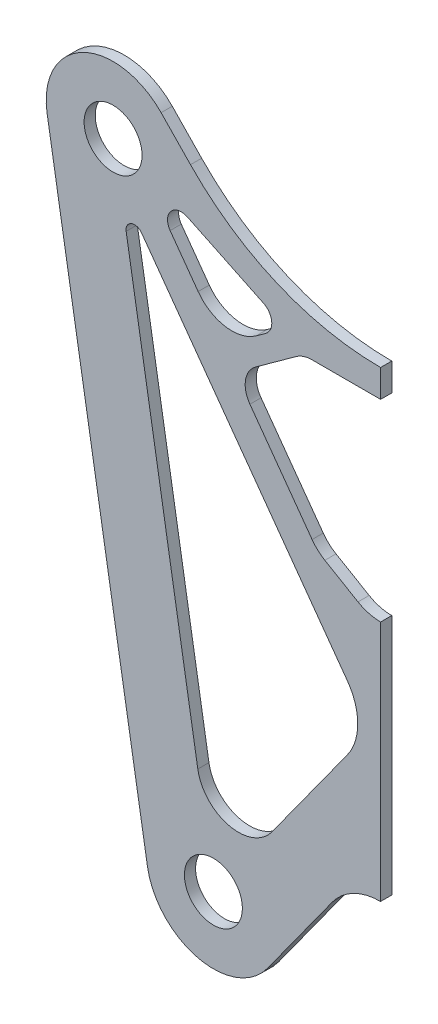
ISO-10303-21;
HEADER;
FILE_DESCRIPTION(('STEP AP214'),'2;1');
FILE_NAME('part.step','',(''),(''),'','','');
FILE_SCHEMA(('AUTOMOTIVE_DESIGN { 1 0 10303 214 1 1 1 1 }'));
ENDSEC;
DATA;
#1=APPLICATION_CONTEXT('core data for automotive mechanical design processes');
#2=APPLICATION_PROTOCOL_DEFINITION('international standard','automotive_design',2000,#1);
#3=PRODUCT_CONTEXT('',#1,'mechanical');
#4=PRODUCT('Part','Part','',(#3));
#5=PRODUCT_RELATED_PRODUCT_CATEGORY('part','',(#4));
#6=PRODUCT_DEFINITION_FORMATION('','',#4);
#7=PRODUCT_DEFINITION_CONTEXT('part definition',#1,'design');
#8=PRODUCT_DEFINITION('design','',#6,#7);
#9=PRODUCT_DEFINITION_SHAPE('','',#8);
#10=(LENGTH_UNIT() NAMED_UNIT(*) SI_UNIT(.MILLI.,.METRE.));
#11=(NAMED_UNIT(*) PLANE_ANGLE_UNIT() SI_UNIT($,.RADIAN.));
#12=(NAMED_UNIT(*) SI_UNIT($,.STERADIAN.) SOLID_ANGLE_UNIT());
#13=UNCERTAINTY_MEASURE_WITH_UNIT(LENGTH_MEASURE(1.E-05),#10,'distance_accuracy_value','');
#14=(GEOMETRIC_REPRESENTATION_CONTEXT(3) GLOBAL_UNCERTAINTY_ASSIGNED_CONTEXT((#13)) GLOBAL_UNIT_ASSIGNED_CONTEXT((#10,
#11,#12)) REPRESENTATION_CONTEXT('',''));
#15=CARTESIAN_POINT('',(0.,0.,0.));
#16=DIRECTION('',(0.,0.,1.));
#17=DIRECTION('',(1.,0.,0.));
#18=AXIS2_PLACEMENT_3D('',#15,#16,#17);
#19=CARTESIAN_POINT('',(-188.917466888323,34.2822252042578,5.));
#20=DIRECTION('',(0.,0.,-1.));
#21=DIRECTION('',(-1.,0.,0.));
#22=AXIS2_PLACEMENT_3D('',#19,#20,#21);
#23=PLANE('',#22);
#24=CARTESIAN_POINT('',(-158.320199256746,14.9860483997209,5.));
#25=DIRECTION('',(0.,0.,1.));
#26=DIRECTION('',(-1.,0.,0.));
#27=AXIS2_PLACEMENT_3D('',#24,#25,#26);
#28=CIRCLE('',#27,6.17368139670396);
#29=CARTESIAN_POINT('',(-155.644158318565,20.5496036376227,5.));
#30=VERTEX_POINT('',#29);
#31=CARTESIAN_POINT('',(-163.325074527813,11.3714162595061,5.));
#32=VERTEX_POINT('',#31);
#33=EDGE_CURVE('E273',#30,#32,#28,.T.);
#34=ORIENTED_EDGE('',*,*,#33,.F.);
#35=DIRECTION('',(-0.901173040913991,0.433459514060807,0.));
#36=VECTOR('',#35,1.);
#37=CARTESIAN_POINT('',(-155.644158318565,20.5496036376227,5.));
#38=LINE('',#37,#36);
#39=CARTESIAN_POINT('',(-121.443837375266,4.09942833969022,5.));
#40=VERTEX_POINT('',#39);
#41=EDGE_CURVE('E285',#40,#30,#38,.T.);
#42=ORIENTED_EDGE('',*,*,#41,.F.);
#43=CARTESIAN_POINT('',(-124.289603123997,-1.8169889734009,5.));
#44=DIRECTION('',(0.,0.,1.));
#45=DIRECTION('',(-1.,0.,0.));
#46=AXIS2_PLACEMENT_3D('',#43,#44,#45);
#47=CIRCLE('',#46,6.56524001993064);
#48=CARTESIAN_POINT('',(-120.445717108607,-7.1392926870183,5.));
#49=VERTEX_POINT('',#48);
#50=EDGE_CURVE('E282',#49,#40,#47,.T.);
#51=ORIENTED_EDGE('',*,*,#50,.F.);
#52=DIRECTION('',(0.810679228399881,0.585490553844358,0.));
#53=VECTOR('',#52,1.);
#54=CARTESIAN_POINT('',(-120.445717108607,-7.1392926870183,5.));
#55=LINE('',#54,#53);
#56=CARTESIAN_POINT('',(-124.720304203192,-10.2264944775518,5.));
#57=VERTEX_POINT('',#56);
#58=EDGE_CURVE('E280',#57,#49,#55,.T.);
#59=ORIENTED_EDGE('',*,*,#58,.F.);
#60=CARTESIAN_POINT('',(-135.640120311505,4.89325090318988,5.));
#61=DIRECTION('',(0.,0.,1.));
#62=DIRECTION('',(-1.,0.,0.));
#63=AXIS2_PLACEMENT_3D('',#60,#61,#62);
#64=CIRCLE('',#63,18.6507126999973);
#65=CARTESIAN_POINT('',(-150.759865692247,-6.02656520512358,5.));
#66=VERTEX_POINT('',#65);
#67=EDGE_CURVE('E278',#66,#57,#64,.T.);
#68=ORIENTED_EDGE('',*,*,#67,.F.);
#69=DIRECTION('',(0.585490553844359,-0.810679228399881,0.));
#70=VECTOR('',#69,1.);
#71=CARTESIAN_POINT('',(-150.759865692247,-6.02656520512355,5.));
#72=LINE('',#71,#70);
#73=EDGE_CURVE('E275',#32,#66,#72,.T.);
#74=ORIENTED_EDGE('',*,*,#73,.F.);
#75=EDGE_LOOP('',(#34,#42,#51,#59,#68,#74));
#76=FACE_BOUND('',#75,.T.);
#77=CARTESIAN_POINT('',(-188.917466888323,34.2822252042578,5.));
#78=DIRECTION('',(0.,0.,1.));
#79=DIRECTION('',(1.,0.,0.));
#80=AXIS2_PLACEMENT_3D('',#77,#78,#79);
#81=CIRCLE('',#80,13.);
#82=CARTESIAN_POINT('',(-175.917466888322,34.2822252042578,5.));
#83=VERTEX_POINT('',#82);
#84=EDGE_CURVE('E324',#83,#83,#81,.T.);
#85=ORIENTED_EDGE('',*,*,#84,.F.);
#86=EDGE_LOOP('',(#85));
#87=FACE_BOUND('',#86,.T.);
#88=CARTESIAN_POINT('',(-188.917466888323,34.2822252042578,5.));
#89=DIRECTION('',(0.,0.,1.));
#90=DIRECTION('',(-1.,0.,0.));
#91=AXIS2_PLACEMENT_3D('',#88,#89,#90);
#92=CIRCLE('',#91,30.);
#93=CARTESIAN_POINT('',(-167.359662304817,55.1451363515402,5.));
#94=VERTEX_POINT('',#93);
#95=CARTESIAN_POINT('',(-218.509284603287,29.3502555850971,5.));
#96=VERTEX_POINT('',#95);
#97=EDGE_CURVE('E330',#94,#96,#92,.T.);
#98=ORIENTED_EDGE('',*,*,#97,.T.);
#99=DIRECTION('',(0.164398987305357,-0.986393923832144,0.));
#100=VECTOR('',#99,1.);
#101=CARTESIAN_POINT('',(-218.509284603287,29.3502555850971,5.));
#102=LINE('',#101,#100);
#103=CARTESIAN_POINT('',(-173.509284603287,-240.649744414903,5.));
#104=VERTEX_POINT('',#103);
#105=EDGE_CURVE('E333',#96,#104,#102,.T.);
#106=ORIENTED_EDGE('',*,*,#105,.T.);
#107=CARTESIAN_POINT('',(-143.917466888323,-235.717774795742,5.));
#108=DIRECTION('',(0.,0.,1.));
#109=DIRECTION('',(-1.,0.,0.));
#110=AXIS2_PLACEMENT_3D('',#107,#108,#109);
#111=CIRCLE('',#110,30.);
#112=CARTESIAN_POINT('',(-119.597090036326,-253.282491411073,5.));
#113=VERTEX_POINT('',#112);
#114=EDGE_CURVE('E336',#104,#113,#111,.T.);
#115=ORIENTED_EDGE('',*,*,#114,.T.);
#116=DIRECTION('',(0.585490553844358,0.810679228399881,0.));
#117=VECTOR('',#116,1.);
#118=CARTESIAN_POINT('',(-119.597090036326,-253.282491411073,5.));
#119=LINE('',#118,#117);
#120=CARTESIAN_POINT('',(-90.5828600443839,-213.108942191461,5.));
#121=VERTEX_POINT('',#120);
#122=EDGE_CURVE('E338',#113,#121,#119,.T.);
#123=ORIENTED_EDGE('',*,*,#122,.T.);
#124=CARTESIAN_POINT('',(-68.9174668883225,-228.756170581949,5.));
#125=DIRECTION('',(0.,0.,-1.));
#126=DIRECTION('',(-1.,0.,0.));
#127=AXIS2_PLACEMENT_3D('',#124,#125,#126);
#128=CIRCLE('',#127,26.7249886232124);
#129=CARTESIAN_POINT('',(-68.9174668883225,-202.031181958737,5.));
#130=VERTEX_POINT('',#129);
#131=EDGE_CURVE('E340',#121,#130,#128,.T.);
#132=ORIENTED_EDGE('',*,*,#131,.T.);
#133=DIRECTION('',(0.,1.,0.));
#134=VECTOR('',#133,1.);
#135=CARTESIAN_POINT('',(-68.9174668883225,-93.4706588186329,5.));
#136=LINE('',#135,#134);
#137=CARTESIAN_POINT('',(-68.9174668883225,-93.4706588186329,5.));
#138=VERTEX_POINT('',#137);
#139=EDGE_CURVE('E342',#130,#138,#136,.T.);
#140=ORIENTED_EDGE('',*,*,#139,.T.);
#141=CARTESIAN_POINT('',(-68.9174668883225,-73.4322190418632,5.));
#142=DIRECTION('',(0.,0.,-1.));
#143=DIRECTION('',(1.,0.,0.));
#144=AXIS2_PLACEMENT_3D('',#141,#142,#143);
#145=CIRCLE('',#144,20.0384397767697);
#146=CARTESIAN_POINT('',(-79.0512504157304,-90.7193674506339,5.));
#147=VERTEX_POINT('',#146);
#148=EDGE_CURVE('E344',#138,#147,#145,.T.);
#149=ORIENTED_EDGE('',*,*,#148,.T.);
#150=DIRECTION('',(-0.862699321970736,0.505717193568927,0.));
#151=VECTOR('',#150,1.);
#152=CARTESIAN_POINT('',(-93.9174668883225,-82.0047422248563,5.));
#153=LINE('',#152,#151);
#154=CARTESIAN_POINT('',(-93.9174668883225,-82.0047422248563,5.));
#155=VERTEX_POINT('',#154);
#156=EDGE_CURVE('E346',#147,#155,#153,.T.);
#157=ORIENTED_EDGE('',*,*,#156,.T.);
#158=CARTESIAN_POINT('',(-84.4106413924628,-65.7871170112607,5.));
#159=DIRECTION('',(0.,0.,-1.));
#160=DIRECTION('',(1.,0.,0.));
#161=AXIS2_PLACEMENT_3D('',#158,#159,#160);
#162=CIRCLE('',#161,18.7986993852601);
#163=CARTESIAN_POINT('',(-99.6503565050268,-76.7935779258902,5.));
#164=VERTEX_POINT('',#163);
#165=EDGE_CURVE('E348',#155,#164,#162,.T.);
#166=ORIENTED_EDGE('',*,*,#165,.T.);
#167=DIRECTION('',(-0.585490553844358,0.810679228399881,0.));
#168=VECTOR('',#167,1.);
#169=CARTESIAN_POINT('',(-127.534912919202,-38.1841921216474,5.));
#170=LINE('',#169,#168);
#171=CARTESIAN_POINT('',(-127.534912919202,-38.1841921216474,5.));
#172=VERTEX_POINT('',#171);
#173=EDGE_CURVE('E350',#164,#172,#170,.T.);
#174=ORIENTED_EDGE('',*,*,#173,.T.);
#175=CARTESIAN_POINT('',(-118.402879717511,-31.5888348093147,5.));
#176=DIRECTION('',(0.,0.,-1.));
#177=DIRECTION('',(1.,0.,0.));
#178=AXIS2_PLACEMENT_3D('',#175,#176,#177);
#179=CIRCLE('',#178,11.2646690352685);
#180=CARTESIAN_POINT('',(-124.998237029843,-22.4568016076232,5.));
#181=VERTEX_POINT('',#180);
#182=EDGE_CURVE('E352',#172,#181,#179,.T.);
#183=ORIENTED_EDGE('',*,*,#182,.T.);
#184=DIRECTION('',(0.810679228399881,0.585490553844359,0.));
#185=VECTOR('',#184,1.);
#186=CARTESIAN_POINT('',(-106.712824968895,-9.25067067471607,5.));
#187=LINE('',#186,#185);
#188=CARTESIAN_POINT('',(-106.712824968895,-9.25067067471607,5.));
#189=VERTEX_POINT('',#188);
#190=EDGE_CURVE('E354',#181,#189,#187,.T.);
#191=ORIENTED_EDGE('',*,*,#190,.T.);
#192=CARTESIAN_POINT('',(-99.7671006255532,-18.8678274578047,5.));
#193=DIRECTION('',(0.,0.,-1.));
#194=DIRECTION('',(1.,0.,0.));
#195=AXIS2_PLACEMENT_3D('',#192,#193,#194);
#196=CIRCLE('',#195,11.8630852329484);
#197=CARTESIAN_POINT('',(-99.7671006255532,-7.0047422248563,5.));
#198=VERTEX_POINT('',#197);
#199=EDGE_CURVE('E356',#189,#198,#196,.T.);
#200=ORIENTED_EDGE('',*,*,#199,.T.);
#201=DIRECTION('',(1.,0.,0.));
#202=VECTOR('',#201,1.);
#203=CARTESIAN_POINT('',(-93.9174668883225,-7.00474222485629,5.));
#204=LINE('',#203,#202);
#205=CARTESIAN_POINT('',(-68.9174668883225,-7.00474222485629,5.));
#206=VERTEX_POINT('',#205);
#207=EDGE_CURVE('E358',#198,#206,#204,.T.);
#208=ORIENTED_EDGE('',*,*,#207,.T.);
#209=DIRECTION('',(0.,1.,0.));
#210=VECTOR('',#209,1.);
#211=CARTESIAN_POINT('',(-68.9174668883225,5.39341110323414,5.));
#212=LINE('',#211,#210);
#213=CARTESIAN_POINT('',(-68.9174668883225,5.39341110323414,5.));
#214=VERTEX_POINT('',#213);
#215=EDGE_CURVE('E360',#206,#214,#212,.T.);
#216=ORIENTED_EDGE('',*,*,#215,.T.);
#217=CARTESIAN_POINT('',(-68.9174668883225,124.056128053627,5.));
#218=DIRECTION('',(0.,0.,-1.));
#219=DIRECTION('',(1.,0.,0.));
#220=AXIS2_PLACEMENT_3D('',#217,#218,#219);
#221=CIRCLE('',#220,118.662716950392);
#222=CARTESIAN_POINT('',(-154.187722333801,41.534470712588,5.));
#223=VERTEX_POINT('',#222);
#224=EDGE_CURVE('E362',#214,#223,#221,.T.);
#225=ORIENTED_EDGE('',*,*,#224,.T.);
#226=DIRECTION('',(-0.69543037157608,0.718593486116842,0.));
#227=VECTOR('',#226,1.);
#228=CARTESIAN_POINT('',(-167.359662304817,55.1451363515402,5.));
#229=LINE('',#228,#227);
#230=EDGE_CURVE('E364',#223,#94,#229,.T.);
#231=ORIENTED_EDGE('',*,*,#230,.T.);
#232=EDGE_LOOP('',(#98,#106,#115,#123,#132,#140,#149,#157,#166,#174,#183,#191,#200,#208,#216,
#225,#231));
#233=FACE_BOUND('',#232,.T.);
#234=CARTESIAN_POINT('',(-143.917466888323,-235.717774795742,5.));
#235=DIRECTION('',(0.,0.,1.));
#236=DIRECTION('',(1.,0.,0.));
#237=AXIS2_PLACEMENT_3D('',#234,#235,#236);
#238=CIRCLE('',#237,13.);
#239=CARTESIAN_POINT('',(-130.917466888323,-235.717774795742,5.));
#240=VERTEX_POINT('',#239);
#241=EDGE_CURVE('E318',#240,#240,#238,.T.);
#242=ORIENTED_EDGE('',*,*,#241,.F.);
#243=EDGE_LOOP('',(#242));
#244=FACE_BOUND('',#243,.T.);
#245=CARTESIAN_POINT('',(-103.663011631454,-138.13402657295,5.));
#246=DIRECTION('',(0.,0.,1.));
#247=DIRECTION('',(1.,0.,0.));
#248=AXIS2_PLACEMENT_3D('',#245,#246,#247);
#249=CIRCLE('',#248,24.5009120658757);
#250=CARTESIAN_POINT('',(-83.8006311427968,-152.479079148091,5.));
#251=VERTEX_POINT('',#250);
#252=CARTESIAN_POINT('',(-83.8006311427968,-123.788973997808,5.));
#253=VERTEX_POINT('',#252);
#254=EDGE_CURVE('E222',#251,#253,#249,.T.);
#255=ORIENTED_EDGE('',*,*,#254,.F.);
#256=DIRECTION('',(0.585490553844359,0.810679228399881,0.));
#257=VECTOR('',#256,1.);
#258=CARTESIAN_POINT('',(-117.668529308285,-199.373091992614,5.));
#259=LINE('',#258,#257);
#260=CARTESIAN_POINT('',(-117.668529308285,-199.373091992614,5.));
#261=VERTEX_POINT('',#260);
#262=EDGE_CURVE('E251',#261,#251,#259,.T.);
#263=ORIENTED_EDGE('',*,*,#262,.F.);
#264=CARTESIAN_POINT('',(-132.665320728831,-188.542075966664,5.));
#265=DIRECTION('',(0.,0.,1.));
#266=DIRECTION('',(1.,0.,0.));
#267=AXIS2_PLACEMENT_3D('',#264,#265,#266);
#268=CIRCLE('',#267,18.499044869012);
#269=CARTESIAN_POINT('',(-150.912666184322,-191.583300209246,5.));
#270=VERTEX_POINT('',#269);
#271=EDGE_CURVE('E249',#270,#261,#268,.T.);
#272=ORIENTED_EDGE('',*,*,#271,.F.);
#273=DIRECTION('',(0.164398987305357,-0.986393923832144,0.));
#274=VECTOR('',#273,1.);
#275=CARTESIAN_POINT('',(-183.047741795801,1.22715345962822,5.));
#276=LINE('',#275,#274);
#277=CARTESIAN_POINT('',(-183.047741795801,1.22715345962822,5.));
#278=VERTEX_POINT('',#277);
#279=EDGE_CURVE('E245',#278,#270,#276,.T.);
#280=ORIENTED_EDGE('',*,*,#279,.F.);
#281=CARTESIAN_POINT('',(-179.269592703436,1.8568449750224,5.));
#282=DIRECTION('',(0.,0.,1.));
#283=DIRECTION('',(1.,0.,0.));
#284=AXIS2_PLACEMENT_3D('',#281,#282,#283);
#285=CIRCLE('',#284,3.8302639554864);
#286=CARTESIAN_POINT('',(-176.164477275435,4.09942833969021,5.));
#287=VERTEX_POINT('',#286);
#288=EDGE_CURVE('E243',#287,#278,#285,.T.);
#289=ORIENTED_EDGE('',*,*,#288,.F.);
#290=DIRECTION('',(-0.585490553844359,0.810679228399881,0.));
#291=VECTOR('',#290,1.);
#292=CARTESIAN_POINT('',(-83.8006311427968,-123.788973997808,5.));
#293=LINE('',#292,#291);
#294=EDGE_CURVE('E230',#253,#287,#293,.T.);
#295=ORIENTED_EDGE('',*,*,#294,.F.);
#296=EDGE_LOOP('',(#255,#263,#272,#280,#289,#295));
#297=FACE_BOUND('',#296,.T.);
#298=ADVANCED_FACE('F31',(#76,#87,#233,#244,#297),#23,.F.);
#299=CARTESIAN_POINT('',(-188.917466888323,34.2822252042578,0.));
#300=DIRECTION('',(0.,0.,-1.));
#301=DIRECTION('',(-1.,0.,0.));
#302=AXIS2_PLACEMENT_3D('',#299,#300,#301);
#303=PLANE('',#302);
#304=DIRECTION('',(-0.901173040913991,0.433459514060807,0.));
#305=VECTOR('',#304,1.);
#306=CARTESIAN_POINT('',(-155.644158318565,20.5496036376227,0.));
#307=LINE('',#306,#305);
#308=CARTESIAN_POINT('',(-121.443837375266,4.09942833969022,0.));
#309=VERTEX_POINT('',#308);
#310=CARTESIAN_POINT('',(-155.644158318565,20.5496036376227,0.));
#311=VERTEX_POINT('',#310);
#312=EDGE_CURVE('E276',#309,#311,#307,.T.);
#313=ORIENTED_EDGE('',*,*,#312,.T.);
#314=CARTESIAN_POINT('',(-158.320199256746,14.9860483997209,0.));
#315=DIRECTION('',(0.,0.,1.));
#316=DIRECTION('',(-1.,0.,0.));
#317=AXIS2_PLACEMENT_3D('',#314,#315,#316);
#318=CIRCLE('',#317,6.17368139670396);
#319=CARTESIAN_POINT('',(-163.325074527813,11.3714162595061,0.));
#320=VERTEX_POINT('',#319);
#321=EDGE_CURVE('E238',#311,#320,#318,.T.);
#322=ORIENTED_EDGE('',*,*,#321,.T.);
#323=DIRECTION('',(0.585490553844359,-0.810679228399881,0.));
#324=VECTOR('',#323,1.);
#325=CARTESIAN_POINT('',(-150.759865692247,-6.02656520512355,0.));
#326=LINE('',#325,#324);
#327=CARTESIAN_POINT('',(-150.759865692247,-6.02656520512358,0.));
#328=VERTEX_POINT('',#327);
#329=EDGE_CURVE('E290',#320,#328,#326,.T.);
#330=ORIENTED_EDGE('',*,*,#329,.T.);
#331=CARTESIAN_POINT('',(-135.640120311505,4.89325090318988,0.));
#332=DIRECTION('',(0.,0.,1.));
#333=DIRECTION('',(-1.,0.,0.));
#334=AXIS2_PLACEMENT_3D('',#331,#332,#333);
#335=CIRCLE('',#334,18.6507126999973);
#336=CARTESIAN_POINT('',(-124.720304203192,-10.2264944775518,0.));
#337=VERTEX_POINT('',#336);
#338=EDGE_CURVE('E293',#328,#337,#335,.T.);
#339=ORIENTED_EDGE('',*,*,#338,.T.);
#340=DIRECTION('',(0.810679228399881,0.585490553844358,0.));
#341=VECTOR('',#340,1.);
#342=CARTESIAN_POINT('',(-120.445717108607,-7.1392926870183,0.));
#343=LINE('',#342,#341);
#344=CARTESIAN_POINT('',(-120.445717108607,-7.1392926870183,0.));
#345=VERTEX_POINT('',#344);
#346=EDGE_CURVE('E296',#337,#345,#343,.T.);
#347=ORIENTED_EDGE('',*,*,#346,.T.);
#348=CARTESIAN_POINT('',(-124.289603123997,-1.8169889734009,0.));
#349=DIRECTION('',(0.,0.,1.));
#350=DIRECTION('',(-1.,0.,0.));
#351=AXIS2_PLACEMENT_3D('',#348,#349,#350);
#352=CIRCLE('',#351,6.56524001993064);
#353=EDGE_CURVE('E299',#345,#309,#352,.T.);
#354=ORIENTED_EDGE('',*,*,#353,.T.);
#355=EDGE_LOOP('',(#313,#322,#330,#339,#347,#354));
#356=FACE_BOUND('',#355,.T.);
#357=CARTESIAN_POINT('',(-188.917466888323,34.2822252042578,0.));
#358=DIRECTION('',(0.,0.,1.));
#359=DIRECTION('',(1.,0.,0.));
#360=AXIS2_PLACEMENT_3D('',#357,#358,#359);
#361=CIRCLE('',#360,13.);
#362=CARTESIAN_POINT('',(-175.917466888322,34.2822252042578,0.));
#363=VERTEX_POINT('',#362);
#364=EDGE_CURVE('E321',#363,#363,#361,.T.);
#365=ORIENTED_EDGE('',*,*,#364,.T.);
#366=EDGE_LOOP('',(#365));
#367=FACE_BOUND('',#366,.T.);
#368=CARTESIAN_POINT('',(-188.917466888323,34.2822252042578,0.));
#369=DIRECTION('',(0.,0.,1.));
#370=DIRECTION('',(-1.,0.,0.));
#371=AXIS2_PLACEMENT_3D('',#368,#369,#370);
#372=CIRCLE('',#371,30.);
#373=CARTESIAN_POINT('',(-167.359662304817,55.1451363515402,0.));
#374=VERTEX_POINT('',#373);
#375=CARTESIAN_POINT('',(-218.509284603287,29.3502555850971,0.));
#376=VERTEX_POINT('',#375);
#377=EDGE_CURVE('E327',#374,#376,#372,.T.);
#378=ORIENTED_EDGE('',*,*,#377,.F.);
#379=DIRECTION('',(-0.69543037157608,0.718593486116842,0.));
#380=VECTOR('',#379,1.);
#381=CARTESIAN_POINT('',(-167.359662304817,55.1451363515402,0.));
#382=LINE('',#381,#380);
#383=CARTESIAN_POINT('',(-154.187722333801,41.534470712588,0.));
#384=VERTEX_POINT('',#383);
#385=EDGE_CURVE('E334',#384,#374,#382,.T.);
#386=ORIENTED_EDGE('',*,*,#385,.F.);
#387=CARTESIAN_POINT('',(-68.9174668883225,124.056128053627,0.));
#388=DIRECTION('',(0.,0.,-1.));
#389=DIRECTION('',(1.,0.,0.));
#390=AXIS2_PLACEMENT_3D('',#387,#388,#389);
#391=CIRCLE('',#390,118.662716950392);
#392=CARTESIAN_POINT('',(-68.9174668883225,5.39341110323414,0.));
#393=VERTEX_POINT('',#392);
#394=EDGE_CURVE('E398',#393,#384,#391,.T.);
#395=ORIENTED_EDGE('',*,*,#394,.F.);
#396=DIRECTION('',(0.,1.,0.));
#397=VECTOR('',#396,1.);
#398=CARTESIAN_POINT('',(-68.9174668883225,5.39341110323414,0.));
#399=LINE('',#398,#397);
#400=CARTESIAN_POINT('',(-68.9174668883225,-7.00474222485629,0.));
#401=VERTEX_POINT('',#400);
#402=EDGE_CURVE('E396',#401,#393,#399,.T.);
#403=ORIENTED_EDGE('',*,*,#402,.F.);
#404=DIRECTION('',(1.,0.,0.));
#405=VECTOR('',#404,1.);
#406=CARTESIAN_POINT('',(-68.9174668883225,-7.00474222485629,0.));
#407=LINE('',#406,#405);
#408=CARTESIAN_POINT('',(-99.7671006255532,-7.0047422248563,0.));
#409=VERTEX_POINT('',#408);
#410=EDGE_CURVE('E394',#409,#401,#407,.T.);
#411=ORIENTED_EDGE('',*,*,#410,.F.);
#412=CARTESIAN_POINT('',(-99.7671006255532,-18.8678274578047,0.));
#413=DIRECTION('',(0.,0.,-1.));
#414=DIRECTION('',(1.,0.,0.));
#415=AXIS2_PLACEMENT_3D('',#412,#413,#414);
#416=CIRCLE('',#415,11.8630852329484);
#417=CARTESIAN_POINT('',(-106.712824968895,-9.25067067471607,0.));
#418=VERTEX_POINT('',#417);
#419=EDGE_CURVE('E391',#418,#409,#416,.T.);
#420=ORIENTED_EDGE('',*,*,#419,.F.);
#421=DIRECTION('',(0.810679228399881,0.585490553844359,0.));
#422=VECTOR('',#421,1.);
#423=CARTESIAN_POINT('',(-106.712824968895,-9.25067067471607,0.));
#424=LINE('',#423,#422);
#425=CARTESIAN_POINT('',(-124.998237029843,-22.4568016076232,0.));
#426=VERTEX_POINT('',#425);
#427=EDGE_CURVE('E389',#426,#418,#424,.T.);
#428=ORIENTED_EDGE('',*,*,#427,.F.);
#429=CARTESIAN_POINT('',(-118.402879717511,-31.5888348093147,0.));
#430=DIRECTION('',(0.,0.,-1.));
#431=DIRECTION('',(1.,0.,0.));
#432=AXIS2_PLACEMENT_3D('',#429,#430,#431);
#433=CIRCLE('',#432,11.2646690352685);
#434=CARTESIAN_POINT('',(-127.534912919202,-38.1841921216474,0.));
#435=VERTEX_POINT('',#434);
#436=EDGE_CURVE('E387',#435,#426,#433,.T.);
#437=ORIENTED_EDGE('',*,*,#436,.F.);
#438=DIRECTION('',(-0.585490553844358,0.810679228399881,0.));
#439=VECTOR('',#438,1.);
#440=CARTESIAN_POINT('',(-127.534912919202,-38.1841921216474,0.));
#441=LINE('',#440,#439);
#442=CARTESIAN_POINT('',(-99.6503565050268,-76.7935779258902,0.));
#443=VERTEX_POINT('',#442);
#444=EDGE_CURVE('E385',#443,#435,#441,.T.);
#445=ORIENTED_EDGE('',*,*,#444,.F.);
#446=CARTESIAN_POINT('',(-84.4106413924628,-65.7871170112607,0.));
#447=DIRECTION('',(0.,0.,-1.));
#448=DIRECTION('',(1.,0.,0.));
#449=AXIS2_PLACEMENT_3D('',#446,#447,#448);
#450=CIRCLE('',#449,18.7986993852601);
#451=CARTESIAN_POINT('',(-93.9174668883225,-82.0047422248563,0.));
#452=VERTEX_POINT('',#451);
#453=EDGE_CURVE('E383',#452,#443,#450,.T.);
#454=ORIENTED_EDGE('',*,*,#453,.F.);
#455=DIRECTION('',(-0.862699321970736,0.505717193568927,0.));
#456=VECTOR('',#455,1.);
#457=CARTESIAN_POINT('',(-93.9174668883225,-82.0047422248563,0.));
#458=LINE('',#457,#456);
#459=CARTESIAN_POINT('',(-79.0512504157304,-90.7193674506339,0.));
#460=VERTEX_POINT('',#459);
#461=EDGE_CURVE('E381',#460,#452,#458,.T.);
#462=ORIENTED_EDGE('',*,*,#461,.F.);
#463=CARTESIAN_POINT('',(-68.9174668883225,-73.4322190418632,0.));
#464=DIRECTION('',(0.,0.,-1.));
#465=DIRECTION('',(1.,0.,0.));
#466=AXIS2_PLACEMENT_3D('',#463,#464,#465);
#467=CIRCLE('',#466,20.0384397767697);
#468=CARTESIAN_POINT('',(-68.9174668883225,-93.4706588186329,0.));
#469=VERTEX_POINT('',#468);
#470=EDGE_CURVE('E379',#469,#460,#467,.T.);
#471=ORIENTED_EDGE('',*,*,#470,.F.);
#472=DIRECTION('',(0.,1.,0.));
#473=VECTOR('',#472,1.);
#474=CARTESIAN_POINT('',(-68.9174668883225,-93.4706588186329,0.));
#475=LINE('',#474,#473);
#476=CARTESIAN_POINT('',(-68.9174668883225,-202.031181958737,0.));
#477=VERTEX_POINT('',#476);
#478=EDGE_CURVE('E377',#477,#469,#475,.T.);
#479=ORIENTED_EDGE('',*,*,#478,.F.);
#480=CARTESIAN_POINT('',(-68.9174668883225,-228.756170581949,0.));
#481=DIRECTION('',(0.,0.,-1.));
#482=DIRECTION('',(-1.,0.,0.));
#483=AXIS2_PLACEMENT_3D('',#480,#481,#482);
#484=CIRCLE('',#483,26.7249886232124);
#485=CARTESIAN_POINT('',(-90.5828600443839,-213.108942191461,0.));
#486=VERTEX_POINT('',#485);
#487=EDGE_CURVE('E375',#486,#477,#484,.T.);
#488=ORIENTED_EDGE('',*,*,#487,.F.);
#489=DIRECTION('',(0.585490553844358,0.810679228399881,0.));
#490=VECTOR('',#489,1.);
#491=CARTESIAN_POINT('',(-119.597090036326,-253.282491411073,0.));
#492=LINE('',#491,#490);
#493=CARTESIAN_POINT('',(-119.597090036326,-253.282491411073,0.));
#494=VERTEX_POINT('',#493);
#495=EDGE_CURVE('E373',#494,#486,#492,.T.);
#496=ORIENTED_EDGE('',*,*,#495,.F.);
#497=CARTESIAN_POINT('',(-143.917466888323,-235.717774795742,0.));
#498=DIRECTION('',(0.,0.,1.));
#499=DIRECTION('',(-1.,0.,0.));
#500=AXIS2_PLACEMENT_3D('',#497,#498,#499);
#501=CIRCLE('',#500,30.);
#502=CARTESIAN_POINT('',(-173.509284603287,-240.649744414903,0.));
#503=VERTEX_POINT('',#502);
#504=EDGE_CURVE('E371',#503,#494,#501,.T.);
#505=ORIENTED_EDGE('',*,*,#504,.F.);
#506=DIRECTION('',(0.164398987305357,-0.986393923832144,0.));
#507=VECTOR('',#506,1.);
#508=CARTESIAN_POINT('',(-218.509284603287,29.3502555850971,0.));
#509=LINE('',#508,#507);
#510=EDGE_CURVE('E369',#376,#503,#509,.T.);
#511=ORIENTED_EDGE('',*,*,#510,.F.);
#512=EDGE_LOOP('',(#378,#386,#395,#403,#411,#420,#428,#437,#445,#454,#462,#471,#479,#488,#496,
#505,#511));
#513=FACE_BOUND('',#512,.T.);
#514=CARTESIAN_POINT('',(-143.917466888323,-235.717774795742,0.));
#515=DIRECTION('',(0.,0.,1.));
#516=DIRECTION('',(1.,0.,0.));
#517=AXIS2_PLACEMENT_3D('',#514,#515,#516);
#518=CIRCLE('',#517,13.);
#519=CARTESIAN_POINT('',(-130.917466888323,-235.717774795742,0.));
#520=VERTEX_POINT('',#519);
#521=EDGE_CURVE('E317',#520,#520,#518,.T.);
#522=ORIENTED_EDGE('',*,*,#521,.T.);
#523=EDGE_LOOP('',(#522));
#524=FACE_BOUND('',#523,.T.);
#525=DIRECTION('',(0.585490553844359,0.810679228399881,0.));
#526=VECTOR('',#525,1.);
#527=CARTESIAN_POINT('',(-117.668529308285,-199.373091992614,0.));
#528=LINE('',#527,#526);
#529=CARTESIAN_POINT('',(-117.668529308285,-199.373091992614,0.));
#530=VERTEX_POINT('',#529);
#531=CARTESIAN_POINT('',(-83.8006311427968,-152.479079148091,0.));
#532=VERTEX_POINT('',#531);
#533=EDGE_CURVE('E231',#530,#532,#528,.T.);
#534=ORIENTED_EDGE('',*,*,#533,.T.);
#535=CARTESIAN_POINT('',(-103.663011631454,-138.13402657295,0.));
#536=DIRECTION('',(0.,0.,1.));
#537=DIRECTION('',(1.,0.,0.));
#538=AXIS2_PLACEMENT_3D('',#535,#536,#537);
#539=CIRCLE('',#538,24.5009120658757);
#540=CARTESIAN_POINT('',(-83.8006311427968,-123.788973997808,0.));
#541=VERTEX_POINT('',#540);
#542=EDGE_CURVE('E54',#532,#541,#539,.T.);
#543=ORIENTED_EDGE('',*,*,#542,.T.);
#544=DIRECTION('',(-0.585490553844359,0.810679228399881,0.));
#545=VECTOR('',#544,1.);
#546=CARTESIAN_POINT('',(-83.8006311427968,-123.788973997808,0.));
#547=LINE('',#546,#545);
#548=CARTESIAN_POINT('',(-176.164477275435,4.09942833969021,0.));
#549=VERTEX_POINT('',#548);
#550=EDGE_CURVE('E237',#541,#549,#547,.T.);
#551=ORIENTED_EDGE('',*,*,#550,.T.);
#552=CARTESIAN_POINT('',(-179.269592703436,1.8568449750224,0.));
#553=DIRECTION('',(0.,0.,1.));
#554=DIRECTION('',(1.,0.,0.));
#555=AXIS2_PLACEMENT_3D('',#552,#553,#554);
#556=CIRCLE('',#555,3.8302639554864);
#557=CARTESIAN_POINT('',(-183.047741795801,1.22715345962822,0.));
#558=VERTEX_POINT('',#557);
#559=EDGE_CURVE('E255',#549,#558,#556,.T.);
#560=ORIENTED_EDGE('',*,*,#559,.T.);
#561=DIRECTION('',(0.164398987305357,-0.986393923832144,0.));
#562=VECTOR('',#561,1.);
#563=CARTESIAN_POINT('',(-183.047741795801,1.22715345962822,0.));
#564=LINE('',#563,#562);
#565=CARTESIAN_POINT('',(-150.912666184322,-191.583300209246,0.));
#566=VERTEX_POINT('',#565);
#567=EDGE_CURVE('E258',#558,#566,#564,.T.);
#568=ORIENTED_EDGE('',*,*,#567,.T.);
#569=CARTESIAN_POINT('',(-132.665320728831,-188.542075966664,0.));
#570=DIRECTION('',(0.,0.,1.));
#571=DIRECTION('',(1.,0.,0.));
#572=AXIS2_PLACEMENT_3D('',#569,#570,#571);
#573=CIRCLE('',#572,18.499044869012);
#574=EDGE_CURVE('E261',#566,#530,#573,.T.);
#575=ORIENTED_EDGE('',*,*,#574,.T.);
#576=EDGE_LOOP('',(#534,#543,#551,#560,#568,#575));
#577=FACE_BOUND('',#576,.T.);
#578=ADVANCED_FACE('F455',(#356,#367,#513,#524,#577),#303,.T.);
#579=CARTESIAN_POINT('',(-188.917466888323,34.2822252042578,5.));
#580=DIRECTION('',(0.,0.,-1.));
#581=DIRECTION('',(-1.,0.,0.));
#582=AXIS2_PLACEMENT_3D('',#579,#580,#581);
#583=CYLINDRICAL_SURFACE('',#582,30.);
#584=ORIENTED_EDGE('',*,*,#377,.T.);
#585=DIRECTION('',(0.,0.,-1.));
#586=VECTOR('',#585,1.);
#587=CARTESIAN_POINT('',(-218.509284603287,29.3502555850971,5.));
#588=LINE('',#587,#586);
#589=EDGE_CURVE('E11',#96,#376,#588,.T.);
#590=ORIENTED_EDGE('',*,*,#589,.F.);
#591=ORIENTED_EDGE('',*,*,#97,.F.);
#592=DIRECTION('',(0.,0.,-1.));
#593=VECTOR('',#592,1.);
#594=CARTESIAN_POINT('',(-167.359662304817,55.1451363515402,5.));
#595=LINE('',#594,#593);
#596=EDGE_CURVE('E366',#94,#374,#595,.T.);
#597=ORIENTED_EDGE('',*,*,#596,.T.);
#598=EDGE_LOOP('',(#584,#590,#591,#597));
#599=FACE_BOUND('',#598,.T.);
#600=ADVANCED_FACE('F33',(#599),#583,.T.);
#601=CARTESIAN_POINT('',(-218.509284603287,29.3502555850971,5.));
#602=DIRECTION('',(0.986393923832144,0.164398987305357,0.));
#603=DIRECTION('',(-0.164398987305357,0.986393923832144,0.));
#604=AXIS2_PLACEMENT_3D('',#601,#602,#603);
#605=PLANE('',#604);
#606=ORIENTED_EDGE('',*,*,#510,.T.);
#607=DIRECTION('',(0.,0.,-1.));
#608=VECTOR('',#607,1.);
#609=CARTESIAN_POINT('',(-173.509284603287,-240.649744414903,5.));
#610=LINE('',#609,#608);
#611=EDGE_CURVE('E39',#104,#503,#610,.T.);
#612=ORIENTED_EDGE('',*,*,#611,.F.);
#613=ORIENTED_EDGE('',*,*,#105,.F.);
#614=ORIENTED_EDGE('',*,*,#589,.T.);
#615=EDGE_LOOP('',(#606,#612,#613,#614));
#616=FACE_BOUND('',#615,.T.);
#617=ADVANCED_FACE('F473',(#616),#605,.F.);
#618=CARTESIAN_POINT('',(-143.917466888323,-235.717774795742,5.));
#619=DIRECTION('',(0.,0.,-1.));
#620=DIRECTION('',(-1.,0.,0.));
#621=AXIS2_PLACEMENT_3D('',#618,#619,#620);
#622=CYLINDRICAL_SURFACE('',#621,30.);
#623=ORIENTED_EDGE('',*,*,#504,.T.);
#624=DIRECTION('',(0.,0.,-1.));
#625=VECTOR('',#624,1.);
#626=CARTESIAN_POINT('',(-119.597090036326,-253.282491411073,5.));
#627=LINE('',#626,#625);
#628=EDGE_CURVE('E442',#113,#494,#627,.T.);
#629=ORIENTED_EDGE('',*,*,#628,.F.);
#630=ORIENTED_EDGE('',*,*,#114,.F.);
#631=ORIENTED_EDGE('',*,*,#611,.T.);
#632=EDGE_LOOP('',(#623,#629,#630,#631));
#633=FACE_BOUND('',#632,.T.);
#634=ADVANCED_FACE('F449',(#633),#622,.T.);
#635=CARTESIAN_POINT('',(-119.597090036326,-253.282491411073,5.));
#636=DIRECTION('',(-0.810679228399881,0.585490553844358,0.));
#637=DIRECTION('',(-0.585490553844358,-0.810679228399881,0.));
#638=AXIS2_PLACEMENT_3D('',#635,#636,#637);
#639=PLANE('',#638);
#640=ORIENTED_EDGE('',*,*,#495,.T.);
#641=DIRECTION('',(0.,0.,-1.));
#642=VECTOR('',#641,1.);
#643=CARTESIAN_POINT('',(-90.5828600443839,-213.108942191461,5.));
#644=LINE('',#643,#642);
#645=EDGE_CURVE('E439',#121,#486,#644,.T.);
#646=ORIENTED_EDGE('',*,*,#645,.F.);
#647=ORIENTED_EDGE('',*,*,#122,.F.);
#648=ORIENTED_EDGE('',*,*,#628,.T.);
#649=EDGE_LOOP('',(#640,#646,#647,#648));
#650=FACE_BOUND('',#649,.T.);
#651=ADVANCED_FACE('F461',(#650),#639,.F.);
#652=CARTESIAN_POINT('',(-68.9174668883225,-228.756170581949,5.));
#653=DIRECTION('',(0.,0.,-1.));
#654=DIRECTION('',(-1.,0.,0.));
#655=AXIS2_PLACEMENT_3D('',#652,#653,#654);
#656=CYLINDRICAL_SURFACE('',#655,26.7249886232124);
#657=ORIENTED_EDGE('',*,*,#487,.T.);
#658=DIRECTION('',(0.,0.,-1.));
#659=VECTOR('',#658,1.);
#660=CARTESIAN_POINT('',(-68.9174668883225,-202.031181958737,5.));
#661=LINE('',#660,#659);
#662=EDGE_CURVE('E436',#130,#477,#661,.T.);
#663=ORIENTED_EDGE('',*,*,#662,.F.);
#664=ORIENTED_EDGE('',*,*,#131,.F.);
#665=ORIENTED_EDGE('',*,*,#645,.T.);
#666=EDGE_LOOP('',(#657,#663,#664,#665));
#667=FACE_BOUND('',#666,.T.);
#668=ADVANCED_FACE('F465',(#667),#656,.F.);
#669=CARTESIAN_POINT('',(-68.9174668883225,-93.4706588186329,5.));
#670=DIRECTION('',(-1.,0.,0.));
#671=DIRECTION('',(0.,0.,1.));
#672=AXIS2_PLACEMENT_3D('',#669,#670,#671);
#673=PLANE('',#672);
#674=ORIENTED_EDGE('',*,*,#478,.T.);
#675=DIRECTION('',(0.,0.,-1.));
#676=VECTOR('',#675,1.);
#677=CARTESIAN_POINT('',(-68.9174668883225,-93.4706588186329,5.));
#678=LINE('',#677,#676);
#679=EDGE_CURVE('E433',#138,#469,#678,.T.);
#680=ORIENTED_EDGE('',*,*,#679,.F.);
#681=ORIENTED_EDGE('',*,*,#139,.F.);
#682=ORIENTED_EDGE('',*,*,#662,.T.);
#683=EDGE_LOOP('',(#674,#680,#681,#682));
#684=FACE_BOUND('',#683,.T.);
#685=ADVANCED_FACE('F530',(#684),#673,.F.);
#686=CARTESIAN_POINT('',(-68.9174668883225,-73.4322190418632,5.));
#687=DIRECTION('',(0.,0.,-1.));
#688=DIRECTION('',(-1.,0.,0.));
#689=AXIS2_PLACEMENT_3D('',#686,#687,#688);
#690=CYLINDRICAL_SURFACE('',#689,20.0384397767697);
#691=ORIENTED_EDGE('',*,*,#470,.T.);
#692=DIRECTION('',(0.,0.,-1.));
#693=VECTOR('',#692,1.);
#694=CARTESIAN_POINT('',(-79.0512504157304,-90.7193674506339,5.));
#695=LINE('',#694,#693);
#696=EDGE_CURVE('E430',#147,#460,#695,.T.);
#697=ORIENTED_EDGE('',*,*,#696,.F.);
#698=ORIENTED_EDGE('',*,*,#148,.F.);
#699=ORIENTED_EDGE('',*,*,#679,.T.);
#700=EDGE_LOOP('',(#691,#697,#698,#699));
#701=FACE_BOUND('',#700,.T.);
#702=ADVANCED_FACE('F528',(#701),#690,.F.);
#703=CARTESIAN_POINT('',(-93.9174668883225,-82.0047422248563,5.));
#704=DIRECTION('',(-0.505717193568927,-0.862699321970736,0.));
#705=DIRECTION('',(0.862699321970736,-0.505717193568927,0.));
#706=AXIS2_PLACEMENT_3D('',#703,#704,#705);
#707=PLANE('',#706);
#708=ORIENTED_EDGE('',*,*,#461,.T.);
#709=DIRECTION('',(0.,0.,-1.));
#710=VECTOR('',#709,1.);
#711=CARTESIAN_POINT('',(-93.9174668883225,-82.0047422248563,5.));
#712=LINE('',#711,#710);
#713=EDGE_CURVE('E427',#155,#452,#712,.T.);
#714=ORIENTED_EDGE('',*,*,#713,.F.);
#715=ORIENTED_EDGE('',*,*,#156,.F.);
#716=ORIENTED_EDGE('',*,*,#696,.T.);
#717=EDGE_LOOP('',(#708,#714,#715,#716));
#718=FACE_BOUND('',#717,.T.);
#719=ADVANCED_FACE('F523',(#718),#707,.F.);
#720=CARTESIAN_POINT('',(-84.4106413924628,-65.7871170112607,5.));
#721=DIRECTION('',(0.,0.,-1.));
#722=DIRECTION('',(-1.,0.,0.));
#723=AXIS2_PLACEMENT_3D('',#720,#721,#722);
#724=CYLINDRICAL_SURFACE('',#723,18.7986993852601);
#725=ORIENTED_EDGE('',*,*,#453,.T.);
#726=DIRECTION('',(0.,0.,-1.));
#727=VECTOR('',#726,1.);
#728=CARTESIAN_POINT('',(-99.6503565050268,-76.7935779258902,5.));
#729=LINE('',#728,#727);
#730=EDGE_CURVE('E424',#164,#443,#729,.T.);
#731=ORIENTED_EDGE('',*,*,#730,.F.);
#732=ORIENTED_EDGE('',*,*,#165,.F.);
#733=ORIENTED_EDGE('',*,*,#713,.T.);
#734=EDGE_LOOP('',(#725,#731,#732,#733));
#735=FACE_BOUND('',#734,.T.);
#736=ADVANCED_FACE('F518',(#735),#724,.F.);
#737=CARTESIAN_POINT('',(-127.534912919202,-38.1841921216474,5.));
#738=DIRECTION('',(-0.810679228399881,-0.585490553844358,0.));
#739=DIRECTION('',(0.585490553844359,-0.810679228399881,0.));
#740=AXIS2_PLACEMENT_3D('',#737,#738,#739);
#741=PLANE('',#740);
#742=ORIENTED_EDGE('',*,*,#444,.T.);
#743=DIRECTION('',(0.,0.,-1.));
#744=VECTOR('',#743,1.);
#745=CARTESIAN_POINT('',(-127.534912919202,-38.1841921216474,5.));
#746=LINE('',#745,#744);
#747=EDGE_CURVE('E421',#172,#435,#746,.T.);
#748=ORIENTED_EDGE('',*,*,#747,.F.);
#749=ORIENTED_EDGE('',*,*,#173,.F.);
#750=ORIENTED_EDGE('',*,*,#730,.T.);
#751=EDGE_LOOP('',(#742,#748,#749,#750));
#752=FACE_BOUND('',#751,.T.);
#753=ADVANCED_FACE('F514',(#752),#741,.F.);
#754=CARTESIAN_POINT('',(-118.402879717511,-31.5888348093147,5.));
#755=DIRECTION('',(0.,0.,-1.));
#756=DIRECTION('',(-1.,0.,0.));
#757=AXIS2_PLACEMENT_3D('',#754,#755,#756);
#758=CYLINDRICAL_SURFACE('',#757,11.2646690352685);
#759=ORIENTED_EDGE('',*,*,#436,.T.);
#760=DIRECTION('',(0.,0.,-1.));
#761=VECTOR('',#760,1.);
#762=CARTESIAN_POINT('',(-124.998237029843,-22.4568016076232,5.));
#763=LINE('',#762,#761);
#764=EDGE_CURVE('E418',#181,#426,#763,.T.);
#765=ORIENTED_EDGE('',*,*,#764,.F.);
#766=ORIENTED_EDGE('',*,*,#182,.F.);
#767=ORIENTED_EDGE('',*,*,#747,.T.);
#768=EDGE_LOOP('',(#759,#765,#766,#767));
#769=FACE_BOUND('',#768,.T.);
#770=ADVANCED_FACE('F510',(#769),#758,.F.);
#771=CARTESIAN_POINT('',(-106.712824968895,-9.25067067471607,5.));
#772=DIRECTION('',(-0.585490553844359,0.810679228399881,0.));
#773=DIRECTION('',(-0.810679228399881,-0.585490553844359,0.));
#774=AXIS2_PLACEMENT_3D('',#771,#772,#773);
#775=PLANE('',#774);
#776=ORIENTED_EDGE('',*,*,#427,.T.);
#777=DIRECTION('',(0.,0.,-1.));
#778=VECTOR('',#777,1.);
#779=CARTESIAN_POINT('',(-106.712824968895,-9.25067067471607,5.));
#780=LINE('',#779,#778);
#781=EDGE_CURVE('E415',#189,#418,#780,.T.);
#782=ORIENTED_EDGE('',*,*,#781,.F.);
#783=ORIENTED_EDGE('',*,*,#190,.F.);
#784=ORIENTED_EDGE('',*,*,#764,.T.);
#785=EDGE_LOOP('',(#776,#782,#783,#784));
#786=FACE_BOUND('',#785,.T.);
#787=ADVANCED_FACE('F505',(#786),#775,.F.);
#788=CARTESIAN_POINT('',(-99.7671006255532,-18.8678274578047,5.));
#789=DIRECTION('',(0.,0.,-1.));
#790=DIRECTION('',(-1.,0.,0.));
#791=AXIS2_PLACEMENT_3D('',#788,#789,#790);
#792=CYLINDRICAL_SURFACE('',#791,11.8630852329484);
#793=ORIENTED_EDGE('',*,*,#419,.T.);
#794=DIRECTION('',(0.,0.,-1.));
#795=VECTOR('',#794,1.);
#796=CARTESIAN_POINT('',(-99.7671006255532,-7.0047422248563,5.));
#797=LINE('',#796,#795);
#798=EDGE_CURVE('E412',#198,#409,#797,.T.);
#799=ORIENTED_EDGE('',*,*,#798,.F.);
#800=ORIENTED_EDGE('',*,*,#199,.F.);
#801=ORIENTED_EDGE('',*,*,#781,.T.);
#802=EDGE_LOOP('',(#793,#799,#800,#801));
#803=FACE_BOUND('',#802,.T.);
#804=ADVANCED_FACE('F496',(#803),#792,.F.);
#805=CARTESIAN_POINT('',(-68.9174668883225,-7.00474222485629,5.));
#806=DIRECTION('',(0.,1.,0.));
#807=DIRECTION('',(0.,0.,1.));
#808=AXIS2_PLACEMENT_3D('',#805,#806,#807);
#809=PLANE('',#808);
#810=ORIENTED_EDGE('',*,*,#410,.T.);
#811=DIRECTION('',(0.,0.,-1.));
#812=VECTOR('',#811,1.);
#813=CARTESIAN_POINT('',(-68.9174668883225,-7.00474222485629,5.));
#814=LINE('',#813,#812);
#815=EDGE_CURVE('E409',#206,#401,#814,.T.);
#816=ORIENTED_EDGE('',*,*,#815,.F.);
#817=ORIENTED_EDGE('',*,*,#207,.F.);
#818=ORIENTED_EDGE('',*,*,#798,.T.);
#819=EDGE_LOOP('',(#810,#816,#817,#818));
#820=FACE_BOUND('',#819,.T.);
#821=ADVANCED_FACE('F500',(#820),#809,.F.);
#822=CARTESIAN_POINT('',(-68.9174668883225,5.39341110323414,5.));
#823=DIRECTION('',(-1.,0.,0.));
#824=DIRECTION('',(0.,0.,1.));
#825=AXIS2_PLACEMENT_3D('',#822,#823,#824);
#826=PLANE('',#825);
#827=ORIENTED_EDGE('',*,*,#402,.T.);
#828=DIRECTION('',(0.,0.,-1.));
#829=VECTOR('',#828,1.);
#830=CARTESIAN_POINT('',(-68.9174668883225,5.39341110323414,5.));
#831=LINE('',#830,#829);
#832=EDGE_CURVE('E406',#214,#393,#831,.T.);
#833=ORIENTED_EDGE('',*,*,#832,.F.);
#834=ORIENTED_EDGE('',*,*,#215,.F.);
#835=ORIENTED_EDGE('',*,*,#815,.T.);
#836=EDGE_LOOP('',(#827,#833,#834,#835));
#837=FACE_BOUND('',#836,.T.);
#838=ADVANCED_FACE('F489',(#837),#826,.F.);
#839=CARTESIAN_POINT('',(-68.9174668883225,124.056128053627,5.));
#840=DIRECTION('',(0.,0.,-1.));
#841=DIRECTION('',(-1.,0.,0.));
#842=AXIS2_PLACEMENT_3D('',#839,#840,#841);
#843=CYLINDRICAL_SURFACE('',#842,118.662716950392);
#844=ORIENTED_EDGE('',*,*,#394,.T.);
#845=DIRECTION('',(0.,0.,-1.));
#846=VECTOR('',#845,1.);
#847=CARTESIAN_POINT('',(-154.187722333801,41.534470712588,5.));
#848=LINE('',#847,#846);
#849=EDGE_CURVE('E403',#223,#384,#848,.T.);
#850=ORIENTED_EDGE('',*,*,#849,.F.);
#851=ORIENTED_EDGE('',*,*,#224,.F.);
#852=ORIENTED_EDGE('',*,*,#832,.T.);
#853=EDGE_LOOP('',(#844,#850,#851,#852));
#854=FACE_BOUND('',#853,.T.);
#855=ADVANCED_FACE('F485',(#854),#843,.F.);
#856=CARTESIAN_POINT('',(-167.359662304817,55.1451363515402,5.));
#857=DIRECTION('',(-0.718593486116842,-0.69543037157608,0.));
#858=DIRECTION('',(0.69543037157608,-0.718593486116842,0.));
#859=AXIS2_PLACEMENT_3D('',#856,#857,#858);
#860=PLANE('',#859);
#861=ORIENTED_EDGE('',*,*,#385,.T.);
#862=ORIENTED_EDGE('',*,*,#596,.F.);
#863=ORIENTED_EDGE('',*,*,#230,.F.);
#864=ORIENTED_EDGE('',*,*,#849,.T.);
#865=EDGE_LOOP('',(#861,#862,#863,#864));
#866=FACE_BOUND('',#865,.T.);
#867=ADVANCED_FACE('F480',(#866),#860,.F.);
#868=CARTESIAN_POINT('',(-188.917466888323,34.2822252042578,5.));
#869=DIRECTION('',(0.,0.,-1.));
#870=DIRECTION('',(-1.,0.,0.));
#871=AXIS2_PLACEMENT_3D('',#868,#869,#870);
#872=CYLINDRICAL_SURFACE('',#871,13.);
#873=ORIENTED_EDGE('',*,*,#84,.T.);
#874=EDGE_LOOP('',(#873));
#875=FACE_BOUND('',#874,.T.);
#876=ORIENTED_EDGE('',*,*,#364,.F.);
#877=EDGE_LOOP('',(#876));
#878=FACE_BOUND('',#877,.T.);
#879=ADVANCED_FACE('F550',(#875,#878),#872,.F.);
#880=CARTESIAN_POINT('',(-143.917466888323,-235.717774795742,5.));
#881=DIRECTION('',(0.,0.,-1.));
#882=DIRECTION('',(-1.,0.,0.));
#883=AXIS2_PLACEMENT_3D('',#880,#881,#882);
#884=CYLINDRICAL_SURFACE('',#883,13.);
#885=ORIENTED_EDGE('',*,*,#241,.T.);
#886=EDGE_LOOP('',(#885));
#887=FACE_BOUND('',#886,.T.);
#888=ORIENTED_EDGE('',*,*,#521,.F.);
#889=EDGE_LOOP('',(#888));
#890=FACE_BOUND('',#889,.T.);
#891=ADVANCED_FACE('F618',(#887,#890),#884,.F.);
#892=CARTESIAN_POINT('',(-158.320199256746,14.9860483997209,5.));
#893=DIRECTION('',(0.,0.,-1.));
#894=DIRECTION('',(-1.,0.,0.));
#895=AXIS2_PLACEMENT_3D('',#892,#893,#894);
#896=CYLINDRICAL_SURFACE('',#895,6.17368139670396);
#897=ORIENTED_EDGE('',*,*,#321,.F.);
#898=DIRECTION('',(0.,0.,-1.));
#899=VECTOR('',#898,1.);
#900=CARTESIAN_POINT('',(-155.644158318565,20.5496036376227,5.));
#901=LINE('',#900,#899);
#902=EDGE_CURVE('E287',#30,#311,#901,.T.);
#903=ORIENTED_EDGE('',*,*,#902,.F.);
#904=ORIENTED_EDGE('',*,*,#33,.T.);
#905=DIRECTION('',(0.,0.,-1.));
#906=VECTOR('',#905,1.);
#907=CARTESIAN_POINT('',(-163.325074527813,11.3714162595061,5.));
#908=LINE('',#907,#906);
#909=EDGE_CURVE('E314',#32,#320,#908,.T.);
#910=ORIENTED_EDGE('',*,*,#909,.T.);
#911=EDGE_LOOP('',(#897,#903,#904,#910));
#912=FACE_BOUND('',#911,.T.);
#913=ADVANCED_FACE('F625',(#912),#896,.F.);
#914=CARTESIAN_POINT('',(-150.759865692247,-6.02656520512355,5.));
#915=DIRECTION('',(0.810679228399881,0.585490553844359,0.));
#916=DIRECTION('',(-0.585490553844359,0.810679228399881,0.));
#917=AXIS2_PLACEMENT_3D('',#914,#915,#916);
#918=PLANE('',#917);
#919=ORIENTED_EDGE('',*,*,#329,.F.);
#920=ORIENTED_EDGE('',*,*,#909,.F.);
#921=ORIENTED_EDGE('',*,*,#73,.T.);
#922=DIRECTION('',(0.,0.,-1.));
#923=VECTOR('',#922,1.);
#924=CARTESIAN_POINT('',(-150.759865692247,-6.02656520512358,5.));
#925=LINE('',#924,#923);
#926=EDGE_CURVE('E312',#66,#328,#925,.T.);
#927=ORIENTED_EDGE('',*,*,#926,.T.);
#928=EDGE_LOOP('',(#919,#920,#921,#927));
#929=FACE_BOUND('',#928,.T.);
#930=ADVANCED_FACE('F632',(#929),#918,.T.);
#931=CARTESIAN_POINT('',(-135.640120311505,4.89325090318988,5.));
#932=DIRECTION('',(0.,0.,-1.));
#933=DIRECTION('',(-1.,0.,0.));
#934=AXIS2_PLACEMENT_3D('',#931,#932,#933);
#935=CYLINDRICAL_SURFACE('',#934,18.6507126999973);
#936=ORIENTED_EDGE('',*,*,#338,.F.);
#937=ORIENTED_EDGE('',*,*,#926,.F.);
#938=ORIENTED_EDGE('',*,*,#67,.T.);
#939=DIRECTION('',(0.,0.,-1.));
#940=VECTOR('',#939,1.);
#941=CARTESIAN_POINT('',(-124.720304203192,-10.2264944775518,5.));
#942=LINE('',#941,#940);
#943=EDGE_CURVE('E310',#57,#337,#942,.T.);
#944=ORIENTED_EDGE('',*,*,#943,.T.);
#945=EDGE_LOOP('',(#936,#937,#938,#944));
#946=FACE_BOUND('',#945,.T.);
#947=ADVANCED_FACE('F640',(#946),#935,.F.);
#948=CARTESIAN_POINT('',(-120.445717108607,-7.1392926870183,5.));
#949=DIRECTION('',(-0.585490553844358,0.810679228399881,0.));
#950=DIRECTION('',(-0.810679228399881,-0.585490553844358,0.));
#951=AXIS2_PLACEMENT_3D('',#948,#949,#950);
#952=PLANE('',#951);
#953=ORIENTED_EDGE('',*,*,#346,.F.);
#954=ORIENTED_EDGE('',*,*,#943,.F.);
#955=ORIENTED_EDGE('',*,*,#58,.T.);
#956=DIRECTION('',(0.,0.,-1.));
#957=VECTOR('',#956,1.);
#958=CARTESIAN_POINT('',(-120.445717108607,-7.1392926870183,5.));
#959=LINE('',#958,#957);
#960=EDGE_CURVE('E308',#49,#345,#959,.T.);
#961=ORIENTED_EDGE('',*,*,#960,.T.);
#962=EDGE_LOOP('',(#953,#954,#955,#961));
#963=FACE_BOUND('',#962,.T.);
#964=ADVANCED_FACE('F648',(#963),#952,.T.);
#965=CARTESIAN_POINT('',(-124.289603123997,-1.8169889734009,5.));
#966=DIRECTION('',(0.,0.,-1.));
#967=DIRECTION('',(-1.,0.,0.));
#968=AXIS2_PLACEMENT_3D('',#965,#966,#967);
#969=CYLINDRICAL_SURFACE('',#968,6.56524001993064);
#970=ORIENTED_EDGE('',*,*,#353,.F.);
#971=ORIENTED_EDGE('',*,*,#960,.F.);
#972=ORIENTED_EDGE('',*,*,#50,.T.);
#973=DIRECTION('',(0.,0.,-1.));
#974=VECTOR('',#973,1.);
#975=CARTESIAN_POINT('',(-121.443837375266,4.09942833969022,5.));
#976=LINE('',#975,#974);
#977=EDGE_CURVE('E306',#40,#309,#976,.T.);
#978=ORIENTED_EDGE('',*,*,#977,.T.);
#979=EDGE_LOOP('',(#970,#971,#972,#978));
#980=FACE_BOUND('',#979,.T.);
#981=ADVANCED_FACE('F656',(#980),#969,.F.);
#982=CARTESIAN_POINT('',(-155.644158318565,20.5496036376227,5.));
#983=DIRECTION('',(-0.433459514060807,-0.901173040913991,0.));
#984=DIRECTION('',(0.901173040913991,-0.433459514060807,0.));
#985=AXIS2_PLACEMENT_3D('',#982,#983,#984);
#986=PLANE('',#985);
#987=ORIENTED_EDGE('',*,*,#312,.F.);
#988=ORIENTED_EDGE('',*,*,#977,.F.);
#989=ORIENTED_EDGE('',*,*,#41,.T.);
#990=ORIENTED_EDGE('',*,*,#902,.T.);
#991=EDGE_LOOP('',(#987,#988,#989,#990));
#992=FACE_BOUND('',#991,.T.);
#993=ADVANCED_FACE('F664',(#992),#986,.T.);
#994=CARTESIAN_POINT('',(-103.663011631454,-138.13402657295,5.));
#995=DIRECTION('',(0.,0.,-1.));
#996=DIRECTION('',(-1.,0.,0.));
#997=AXIS2_PLACEMENT_3D('',#994,#995,#996);
#998=CYLINDRICAL_SURFACE('',#997,24.5009120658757);
#999=ORIENTED_EDGE('',*,*,#542,.F.);
#1000=DIRECTION('',(0.,0.,-1.));
#1001=VECTOR('',#1000,1.);
#1002=CARTESIAN_POINT('',(-83.8006311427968,-152.479079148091,5.));
#1003=LINE('',#1002,#1001);
#1004=EDGE_CURVE('E226',#251,#532,#1003,.T.);
#1005=ORIENTED_EDGE('',*,*,#1004,.F.);
#1006=ORIENTED_EDGE('',*,*,#254,.T.);
#1007=DIRECTION('',(0.,0.,-1.));
#1008=VECTOR('',#1007,1.);
#1009=CARTESIAN_POINT('',(-83.8006311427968,-123.788973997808,5.));
#1010=LINE('',#1009,#1008);
#1011=EDGE_CURVE('E225',#253,#541,#1010,.T.);
#1012=ORIENTED_EDGE('',*,*,#1011,.T.);
#1013=EDGE_LOOP('',(#999,#1005,#1006,#1012));
#1014=FACE_BOUND('',#1013,.T.);
#1015=ADVANCED_FACE('F224',(#1014),#998,.F.);
#1016=CARTESIAN_POINT('',(-83.8006311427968,-123.788973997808,5.));
#1017=DIRECTION('',(-0.810679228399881,-0.585490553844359,0.));
#1018=DIRECTION('',(0.585490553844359,-0.810679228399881,0.));
#1019=AXIS2_PLACEMENT_3D('',#1016,#1017,#1018);
#1020=PLANE('',#1019);
#1021=ORIENTED_EDGE('',*,*,#550,.F.);
#1022=ORIENTED_EDGE('',*,*,#1011,.F.);
#1023=ORIENTED_EDGE('',*,*,#294,.T.);
#1024=DIRECTION('',(0.,0.,-1.));
#1025=VECTOR('',#1024,1.);
#1026=CARTESIAN_POINT('',(-176.164477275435,4.09942833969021,5.));
#1027=LINE('',#1026,#1025);
#1028=EDGE_CURVE('E239',#287,#549,#1027,.T.);
#1029=ORIENTED_EDGE('',*,*,#1028,.T.);
#1030=EDGE_LOOP('',(#1021,#1022,#1023,#1029));
#1031=FACE_BOUND('',#1030,.T.);
#1032=ADVANCED_FACE('F234',(#1031),#1020,.T.);
#1033=CARTESIAN_POINT('',(-179.269592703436,1.8568449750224,5.));
#1034=DIRECTION('',(0.,0.,-1.));
#1035=DIRECTION('',(-1.,0.,0.));
#1036=AXIS2_PLACEMENT_3D('',#1033,#1034,#1035);
#1037=CYLINDRICAL_SURFACE('',#1036,3.8302639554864);
#1038=ORIENTED_EDGE('',*,*,#559,.F.);
#1039=ORIENTED_EDGE('',*,*,#1028,.F.);
#1040=ORIENTED_EDGE('',*,*,#288,.T.);
#1041=DIRECTION('',(0.,0.,-1.));
#1042=VECTOR('',#1041,1.);
#1043=CARTESIAN_POINT('',(-183.047741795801,1.22715345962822,5.));
#1044=LINE('',#1043,#1042);
#1045=EDGE_CURVE('E270',#278,#558,#1044,.T.);
#1046=ORIENTED_EDGE('',*,*,#1045,.T.);
#1047=EDGE_LOOP('',(#1038,#1039,#1040,#1046));
#1048=FACE_BOUND('',#1047,.T.);
#1049=ADVANCED_FACE('F685',(#1048),#1037,.F.);
#1050=CARTESIAN_POINT('',(-183.047741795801,1.22715345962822,5.));
#1051=DIRECTION('',(0.986393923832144,0.164398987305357,0.));
#1052=DIRECTION('',(-0.164398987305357,0.986393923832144,0.));
#1053=AXIS2_PLACEMENT_3D('',#1050,#1051,#1052);
#1054=PLANE('',#1053);
#1055=ORIENTED_EDGE('',*,*,#567,.F.);
#1056=ORIENTED_EDGE('',*,*,#1045,.F.);
#1057=ORIENTED_EDGE('',*,*,#279,.T.);
#1058=DIRECTION('',(0.,0.,-1.));
#1059=VECTOR('',#1058,1.);
#1060=CARTESIAN_POINT('',(-150.912666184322,-191.583300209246,5.));
#1061=LINE('',#1060,#1059);
#1062=EDGE_CURVE('E268',#270,#566,#1061,.T.);
#1063=ORIENTED_EDGE('',*,*,#1062,.T.);
#1064=EDGE_LOOP('',(#1055,#1056,#1057,#1063));
#1065=FACE_BOUND('',#1064,.T.);
#1066=ADVANCED_FACE('F692',(#1065),#1054,.T.);
#1067=CARTESIAN_POINT('',(-132.665320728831,-188.542075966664,5.));
#1068=DIRECTION('',(0.,0.,-1.));
#1069=DIRECTION('',(-1.,0.,0.));
#1070=AXIS2_PLACEMENT_3D('',#1067,#1068,#1069);
#1071=CYLINDRICAL_SURFACE('',#1070,18.499044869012);
#1072=ORIENTED_EDGE('',*,*,#574,.F.);
#1073=ORIENTED_EDGE('',*,*,#1062,.F.);
#1074=ORIENTED_EDGE('',*,*,#271,.T.);
#1075=DIRECTION('',(0.,0.,-1.));
#1076=VECTOR('',#1075,1.);
#1077=CARTESIAN_POINT('',(-117.668529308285,-199.373091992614,5.));
#1078=LINE('',#1077,#1076);
#1079=EDGE_CURVE('E46',#261,#530,#1078,.T.);
#1080=ORIENTED_EDGE('',*,*,#1079,.T.);
#1081=EDGE_LOOP('',(#1072,#1073,#1074,#1080));
#1082=FACE_BOUND('',#1081,.T.);
#1083=ADVANCED_FACE('F700',(#1082),#1071,.F.);
#1084=CARTESIAN_POINT('',(-117.668529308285,-199.373091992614,5.));
#1085=DIRECTION('',(-0.810679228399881,0.585490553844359,0.));
#1086=DIRECTION('',(-0.585490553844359,-0.810679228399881,0.));
#1087=AXIS2_PLACEMENT_3D('',#1084,#1085,#1086);
#1088=PLANE('',#1087);
#1089=ORIENTED_EDGE('',*,*,#533,.F.);
#1090=ORIENTED_EDGE('',*,*,#1079,.F.);
#1091=ORIENTED_EDGE('',*,*,#262,.T.);
#1092=ORIENTED_EDGE('',*,*,#1004,.T.);
#1093=EDGE_LOOP('',(#1089,#1090,#1091,#1092));
#1094=FACE_BOUND('',#1093,.T.);
#1095=ADVANCED_FACE('F708',(#1094),#1088,.T.);
#1096=CLOSED_SHELL('',(#298,#578,#600,#617,#634,#651,#668,#685,#702,#719,#736,#753,#770,#787,
#804,#821,#838,#855,#867,#879,#891,#913,#930,#947,#964,#981,#993,#1015,#1032,#1049,#1066,#1083,#1095));
#1097=MANIFOLD_SOLID_BREP('B2',#1096);
#1098=ADVANCED_BREP_SHAPE_REPRESENTATION('',(#18,#1097),#14);
#1099=SHAPE_DEFINITION_REPRESENTATION(#9,#1098);
ENDSEC;
END-ISO-10303-21;
